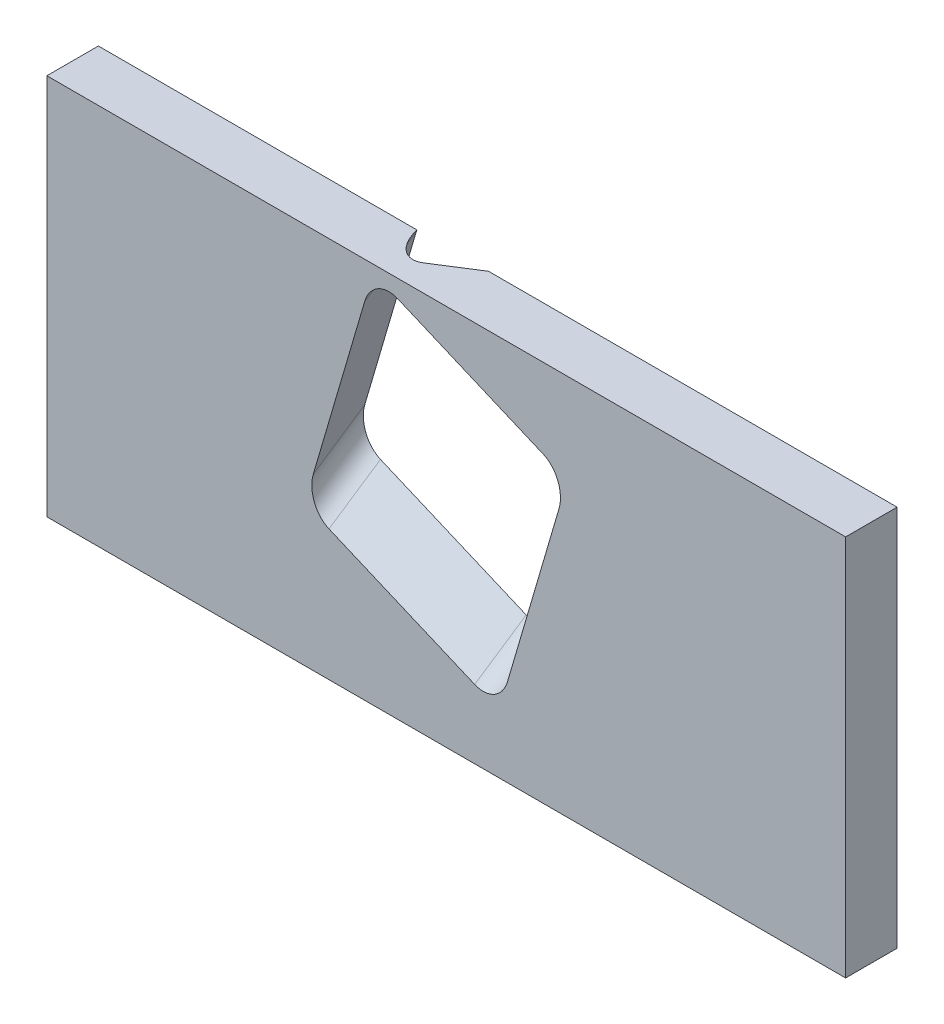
ISO-10303-21;
HEADER;
FILE_DESCRIPTION(('STEP AP214'),'2;1');
FILE_NAME('part.step','',(''),(''),'','','');
FILE_SCHEMA(('AUTOMOTIVE_DESIGN { 1 0 10303 214 1 1 1 1 }'));
ENDSEC;
DATA;
#1=APPLICATION_CONTEXT('core data for automotive mechanical design processes');
#2=APPLICATION_PROTOCOL_DEFINITION('international standard','automotive_design',2000,#1);
#3=PRODUCT_CONTEXT('',#1,'mechanical');
#4=PRODUCT('Part','Part','',(#3));
#5=PRODUCT_RELATED_PRODUCT_CATEGORY('part','',(#4));
#6=PRODUCT_DEFINITION_FORMATION('','',#4);
#7=PRODUCT_DEFINITION_CONTEXT('part definition',#1,'design');
#8=PRODUCT_DEFINITION('design','',#6,#7);
#9=PRODUCT_DEFINITION_SHAPE('','',#8);
#10=(LENGTH_UNIT() NAMED_UNIT(*) SI_UNIT(.MILLI.,.METRE.));
#11=(NAMED_UNIT(*) PLANE_ANGLE_UNIT() SI_UNIT($,.RADIAN.));
#12=(NAMED_UNIT(*) SI_UNIT($,.STERADIAN.) SOLID_ANGLE_UNIT());
#13=UNCERTAINTY_MEASURE_WITH_UNIT(LENGTH_MEASURE(1.E-05),#10,'distance_accuracy_value','');
#14=(GEOMETRIC_REPRESENTATION_CONTEXT(3) GLOBAL_UNCERTAINTY_ASSIGNED_CONTEXT((#13)) GLOBAL_UNIT_ASSIGNED_CONTEXT((#10,
#11,#12)) REPRESENTATION_CONTEXT('',''));
#15=CARTESIAN_POINT('',(0.,0.,0.));
#16=DIRECTION('',(0.,0.,1.));
#17=DIRECTION('',(1.,0.,0.));
#18=AXIS2_PLACEMENT_3D('',#15,#16,#17);
#19=CARTESIAN_POINT('',(-37.7894050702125,88.7717658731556,5.));
#20=DIRECTION('',(0.,-1.,0.));
#21=DIRECTION('',(0.,0.,-1.));
#22=AXIS2_PLACEMENT_3D('',#19,#20,#21);
#23=PLANE('',#22);
#24=CARTESIAN_POINT('',(-4.57644112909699,88.7717658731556,-1.80738180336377));
#25=DIRECTION('',(0.,-1.,0.));
#26=DIRECTION('',(0.,0.,1.));
#27=AXIS2_PLACEMENT_3D('',#24,#25,#26);
#28=ELLIPSE('',#27,4.49684408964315,2.5);
#29=CARTESIAN_POINT('',(-6.8656255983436,88.7717658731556,0.));
#30=VERTEX_POINT('',#29);
#31=CARTESIAN_POINT('',(-3.74443136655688,88.7717658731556,2.43312443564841));
#32=VERTEX_POINT('',#31);
#33=EDGE_CURVE('E188',#30,#32,#28,.F.);
#34=ORIENTED_EDGE('',*,*,#33,.F.);
#35=DIRECTION('',(-1.,0.,0.));
#36=VECTOR('',#35,1.);
#37=CARTESIAN_POINT('',(-37.7894050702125,88.7717658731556,0.));
#38=LINE('',#37,#36);
#39=CARTESIAN_POINT('',(-37.7894050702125,88.7717658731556,0.));
#40=VERTEX_POINT('',#39);
#41=EDGE_CURVE('E170',#30,#40,#38,.T.);
#42=ORIENTED_EDGE('',*,*,#41,.T.);
#43=DIRECTION('',(0.,0.,-1.));
#44=VECTOR('',#43,1.);
#45=CARTESIAN_POINT('',(-37.7894050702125,88.7717658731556,5.));
#46=LINE('',#45,#44);
#47=CARTESIAN_POINT('',(-37.7894050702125,88.7717658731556,5.));
#48=VERTEX_POINT('',#47);
#49=EDGE_CURVE('E160',#48,#40,#46,.T.);
#50=ORIENTED_EDGE('',*,*,#49,.F.);
#51=DIRECTION('',(-1.,0.,0.));
#52=VECTOR('',#51,1.);
#53=CARTESIAN_POINT('',(-37.7894050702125,88.7717658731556,5.));
#54=LINE('',#53,#52);
#55=CARTESIAN_POINT('',(39.7561399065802,88.7717658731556,5.));
#56=VERTEX_POINT('',#55);
#57=EDGE_CURVE('E147',#56,#48,#54,.T.);
#58=ORIENTED_EDGE('',*,*,#57,.F.);
#59=DIRECTION('',(0.,0.,-1.));
#60=VECTOR('',#59,1.);
#61=CARTESIAN_POINT('',(39.7561399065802,88.7717658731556,5.));
#62=LINE('',#61,#60);
#63=CARTESIAN_POINT('',(39.7561399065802,88.7717658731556,0.));
#64=VERTEX_POINT('',#63);
#65=EDGE_CURVE('E167',#56,#64,#62,.T.);
#66=ORIENTED_EDGE('',*,*,#65,.T.);
#67=CARTESIAN_POINT('',(0.0883845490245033,88.7717658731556,0.));
#68=VERTEX_POINT('',#67);
#69=EDGE_CURVE('E151',#64,#68,#38,.T.);
#70=ORIENTED_EDGE('',*,*,#69,.T.);
#71=DIRECTION('',(0.844253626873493,0.,-0.535943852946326));
#72=VECTOR('',#71,1.);
#73=CARTESIAN_POINT('',(-29.1719100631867,88.7717658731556,18.5748388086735));
#74=LINE('',#73,#72);
#75=EDGE_CURVE('E195',#32,#68,#74,.T.);
#76=ORIENTED_EDGE('',*,*,#75,.F.);
#77=EDGE_LOOP('',(#34,#42,#50,#58,#66,#70,#76));
#78=FACE_BOUND('',#77,.T.);
#79=ADVANCED_FACE('F33',(#78),#23,.F.);
#80=CARTESIAN_POINT('',(-37.7894050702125,51.6847661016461,5.));
#81=DIRECTION('',(0.,0.,1.));
#82=DIRECTION('',(1.,0.,0.));
#83=AXIS2_PLACEMENT_3D('',#80,#81,#82);
#84=PLANE('',#83);
#85=DIRECTION('',(0.,-1.,0.));
#86=VECTOR('',#85,1.);
#87=CARTESIAN_POINT('',(-37.7894050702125,88.7717658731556,5.));
#88=LINE('',#87,#86);
#89=CARTESIAN_POINT('',(-37.7894050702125,51.6847661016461,5.));
#90=VERTEX_POINT('',#89);
#91=EDGE_CURVE('E142',#48,#90,#88,.T.);
#92=ORIENTED_EDGE('',*,*,#91,.T.);
#93=DIRECTION('',(1.,0.,0.));
#94=VECTOR('',#93,1.);
#95=CARTESIAN_POINT('',(-37.7894050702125,51.6847661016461,5.));
#96=LINE('',#95,#94);
#97=CARTESIAN_POINT('',(39.7561399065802,51.6847661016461,5.));
#98=VERTEX_POINT('',#97);
#99=EDGE_CURVE('E131',#90,#98,#96,.T.);
#100=ORIENTED_EDGE('',*,*,#99,.T.);
#101=DIRECTION('',(0.,1.,0.));
#102=VECTOR('',#101,1.);
#103=CARTESIAN_POINT('',(39.7561399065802,88.7717658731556,5.));
#104=LINE('',#103,#102);
#105=EDGE_CURVE('E141',#98,#56,#104,.T.);
#106=ORIENTED_EDGE('',*,*,#105,.T.);
#107=ORIENTED_EDGE('',*,*,#57,.T.);
#108=EDGE_LOOP('',(#92,#100,#106,#107));
#109=FACE_BOUND('',#108,.T.);
#110=DIRECTION('',(-0.920468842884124,0.390815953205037,0.));
#111=VECTOR('',#110,1.);
#112=CARTESIAN_POINT('',(-29.0444218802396,72.2813781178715,5.));
#113=LINE('',#112,#111);
#114=CARTESIAN_POINT('',(3.74443136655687,58.359769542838,5.));
#115=VERTEX_POINT('',#114);
#116=CARTESIAN_POINT('',(-10.4005094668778,64.3654791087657,5.));
#117=VERTEX_POINT('',#116);
#118=EDGE_CURVE('E98',#115,#117,#113,.T.);
#119=ORIENTED_EDGE('',*,*,#118,.T.);
#120=CARTESIAN_POINT('',(-9.56849970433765,67.2016639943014,5.));
#121=DIRECTION('',(0.,0.,1.));
#122=DIRECTION('',(0.,-1.,0.));
#123=AXIS2_PLACEMENT_3D('',#120,#121,#122);
#124=ELLIPSE('',#123,3.0076317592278,2.5);
#125=CARTESIAN_POINT('',(-11.9259898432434,68.2026155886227,5.));
#126=VERTEX_POINT('',#125);
#127=EDGE_CURVE('E178',#117,#126,#124,.F.);
#128=ORIENTED_EDGE('',*,*,#127,.T.);
#129=DIRECTION('',(0.281492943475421,0.95956329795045,0.));
#130=VECTOR('',#129,1.);
#131=CARTESIAN_POINT('',(-18.4370035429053,46.0076372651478,5.));
#132=LINE('',#131,#130);
#133=CARTESIAN_POINT('',(-6.93393126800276,85.2197249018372,5.));
#134=VERTEX_POINT('',#133);
#135=EDGE_CURVE('E181',#126,#134,#132,.T.);
#136=ORIENTED_EDGE('',*,*,#135,.T.);
#137=CARTESIAN_POINT('',(-4.57644112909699,84.2187733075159,5.));
#138=DIRECTION('',(0.,0.,1.));
#139=DIRECTION('',(0.,-1.,0.));
#140=AXIS2_PLACEMENT_3D('',#137,#138,#139);
#141=ELLIPSE('',#140,3.0076317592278,2.5);
#142=CARTESIAN_POINT('',(-3.74443136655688,87.0549581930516,5.));
#143=VERTEX_POINT('',#142);
#144=EDGE_CURVE('E184',#134,#143,#141,.F.);
#145=ORIENTED_EDGE('',*,*,#144,.T.);
#146=DIRECTION('',(0.920468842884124,-0.390815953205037,0.));
#147=VECTOR('',#146,1.);
#148=CARTESIAN_POINT('',(-19.865616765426,93.8997487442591,5.));
#149=LINE('',#148,#147);
#150=CARTESIAN_POINT('',(10.4005094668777,81.0492486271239,5.));
#151=VERTEX_POINT('',#150);
#152=EDGE_CURVE('E187',#143,#151,#149,.T.);
#153=ORIENTED_EDGE('',*,*,#152,.T.);
#154=CARTESIAN_POINT('',(9.56849970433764,78.2130637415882,5.));
#155=DIRECTION('',(0.,0.,1.));
#156=DIRECTION('',(0.,-1.,0.));
#157=AXIS2_PLACEMENT_3D('',#154,#155,#156);
#158=ELLIPSE('',#157,3.0076317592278,2.5);
#159=CARTESIAN_POINT('',(11.9259898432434,77.2121121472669,5.));
#160=VERTEX_POINT('',#159);
#161=EDGE_CURVE('E194',#151,#160,#158,.F.);
#162=ORIENTED_EDGE('',*,*,#161,.T.);
#163=DIRECTION('',(-0.281492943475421,-0.95956329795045,0.));
#164=VECTOR('',#163,1.);
#165=CARTESIAN_POINT('',(1.09142857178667,40.2788689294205,5.));
#166=LINE('',#165,#164);
#167=CARTESIAN_POINT('',(6.93393126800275,60.1950028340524,5.));
#168=VERTEX_POINT('',#167);
#169=EDGE_CURVE('E201',#160,#168,#166,.T.);
#170=ORIENTED_EDGE('',*,*,#169,.T.);
#171=CARTESIAN_POINT('',(4.57644112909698,61.1959544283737,5.));
#172=DIRECTION('',(0.,0.,1.));
#173=DIRECTION('',(0.,-1.,0.));
#174=AXIS2_PLACEMENT_3D('',#171,#172,#173);
#175=ELLIPSE('',#174,3.0076317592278,2.5);
#176=EDGE_CURVE('E175',#168,#115,#175,.F.);
#177=ORIENTED_EDGE('',*,*,#176,.T.);
#178=EDGE_LOOP('',(#119,#128,#136,#145,#153,#162,#170,#177));
#179=FACE_BOUND('',#178,.T.);
#180=ADVANCED_FACE('F35',(#109,#179),#84,.T.);
#181=CARTESIAN_POINT('',(-37.7894050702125,51.6847661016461,0.));
#182=DIRECTION('',(0.,0.,1.));
#183=DIRECTION('',(1.,0.,0.));
#184=AXIS2_PLACEMENT_3D('',#181,#182,#183);
#185=PLANE('',#184);
#186=CARTESIAN_POINT('',(-4.57644112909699,87.5629316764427,0.));
#187=DIRECTION('',(0.,0.,1.));
#188=DIRECTION('',(0.,-1.,0.));
#189=AXIS2_PLACEMENT_3D('',#186,#187,#188);
#190=ELLIPSE('',#189,3.0076317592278,2.5);
#191=CARTESIAN_POINT('',(-6.93393126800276,88.563883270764,0.));
#192=VERTEX_POINT('',#191);
#193=EDGE_CURVE('E191',#192,#30,#190,.F.);
#194=ORIENTED_EDGE('',*,*,#193,.F.);
#195=DIRECTION('',(0.281492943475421,0.95956329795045,0.));
#196=VECTOR('',#195,1.);
#197=CARTESIAN_POINT('',(-19.3402951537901,46.2726226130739,0.));
#198=LINE('',#197,#196);
#199=CARTESIAN_POINT('',(-11.9259898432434,71.5467739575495,0.));
#200=VERTEX_POINT('',#199);
#201=EDGE_CURVE('E210',#200,#192,#198,.T.);
#202=ORIENTED_EDGE('',*,*,#201,.F.);
#203=CARTESIAN_POINT('',(-9.56849970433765,70.5458223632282,0.));
#204=DIRECTION('',(0.,0.,1.));
#205=DIRECTION('',(0.,-1.,0.));
#206=AXIS2_PLACEMENT_3D('',#203,#204,#205);
#207=ELLIPSE('',#206,3.0076317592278,2.5);
#208=CARTESIAN_POINT('',(-10.4005094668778,67.7096374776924,0.));
#209=VERTEX_POINT('',#208);
#210=EDGE_CURVE('E43',#209,#200,#207,.F.);
#211=ORIENTED_EDGE('',*,*,#210,.F.);
#212=DIRECTION('',(-0.920468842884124,0.390815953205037,0.));
#213=VECTOR('',#212,1.);
#214=CARTESIAN_POINT('',(-27.8414147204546,75.1147594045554,0.));
#215=LINE('',#214,#213);
#216=CARTESIAN_POINT('',(3.74443136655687,61.7039279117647,0.));
#217=VERTEX_POINT('',#216);
#218=EDGE_CURVE('E164',#217,#209,#215,.T.);
#219=ORIENTED_EDGE('',*,*,#218,.F.);
#220=CARTESIAN_POINT('',(4.57644112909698,64.5401127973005,0.));
#221=DIRECTION('',(0.,0.,1.));
#222=DIRECTION('',(0.,-1.,0.));
#223=AXIS2_PLACEMENT_3D('',#220,#221,#222);
#224=ELLIPSE('',#223,3.0076317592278,2.5);
#225=CARTESIAN_POINT('',(6.93393126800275,63.5391612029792,0.));
#226=VERTEX_POINT('',#225);
#227=EDGE_CURVE('E223',#226,#217,#224,.F.);
#228=ORIENTED_EDGE('',*,*,#227,.F.);
#229=DIRECTION('',(-0.281492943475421,-0.95956329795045,0.));
#230=VECTOR('',#229,1.);
#231=CARTESIAN_POINT('',(0.188136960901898,40.5438542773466,0.));
#232=LINE('',#231,#230);
#233=CARTESIAN_POINT('',(11.9259898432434,80.5562705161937,0.));
#234=VERTEX_POINT('',#233);
#235=EDGE_CURVE('E221',#234,#226,#232,.T.);
#236=ORIENTED_EDGE('',*,*,#235,.F.);
#237=CARTESIAN_POINT('',(9.56849970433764,81.557222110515,0.));
#238=DIRECTION('',(0.,0.,1.));
#239=DIRECTION('',(0.,-1.,0.));
#240=AXIS2_PLACEMENT_3D('',#237,#238,#239);
#241=ELLIPSE('',#240,3.0076317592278,2.5);
#242=CARTESIAN_POINT('',(10.4005094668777,84.3934069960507,0.));
#243=VERTEX_POINT('',#242);
#244=EDGE_CURVE('E218',#243,#234,#241,.F.);
#245=ORIENTED_EDGE('',*,*,#244,.F.);
#246=DIRECTION('',(0.920468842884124,-0.390815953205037,0.));
#247=VECTOR('',#246,1.);
#248=CARTESIAN_POINT('',(-18.6626096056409,96.733130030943,0.));
#249=LINE('',#248,#247);
#250=EDGE_CURVE('E197',#68,#243,#249,.T.);
#251=ORIENTED_EDGE('',*,*,#250,.F.);
#252=ORIENTED_EDGE('',*,*,#69,.F.);
#253=DIRECTION('',(0.,1.,0.));
#254=VECTOR('',#253,1.);
#255=CARTESIAN_POINT('',(39.7561399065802,88.7717658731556,0.));
#256=LINE('',#255,#254);
#257=CARTESIAN_POINT('',(39.7561399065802,51.6847661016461,0.));
#258=VERTEX_POINT('',#257);
#259=EDGE_CURVE('E156',#258,#64,#256,.T.);
#260=ORIENTED_EDGE('',*,*,#259,.F.);
#261=DIRECTION('',(1.,0.,0.));
#262=VECTOR('',#261,1.);
#263=CARTESIAN_POINT('',(-37.7894050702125,51.6847661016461,0.));
#264=LINE('',#263,#262);
#265=CARTESIAN_POINT('',(-37.7894050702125,51.6847661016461,0.));
#266=VERTEX_POINT('',#265);
#267=EDGE_CURVE('E157',#266,#258,#264,.T.);
#268=ORIENTED_EDGE('',*,*,#267,.F.);
#269=DIRECTION('',(0.,-1.,0.));
#270=VECTOR('',#269,1.);
#271=CARTESIAN_POINT('',(-37.7894050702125,88.7717658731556,0.));
#272=LINE('',#271,#270);
#273=EDGE_CURVE('E155',#40,#266,#272,.T.);
#274=ORIENTED_EDGE('',*,*,#273,.F.);
#275=ORIENTED_EDGE('',*,*,#41,.F.);
#276=EDGE_LOOP('',(#194,#202,#211,#219,#228,#236,#245,#251,#252,#260,#268,#274,#275));
#277=FACE_BOUND('',#276,.T.);
#278=ADVANCED_FACE('F246',(#277),#185,.F.);
#279=CARTESIAN_POINT('',(-37.7894050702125,88.7717658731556,5.));
#280=DIRECTION('',(1.,0.,0.));
#281=DIRECTION('',(0.,0.,-1.));
#282=AXIS2_PLACEMENT_3D('',#279,#280,#281);
#283=PLANE('',#282);
#284=ORIENTED_EDGE('',*,*,#273,.T.);
#285=DIRECTION('',(0.,0.,-1.));
#286=VECTOR('',#285,1.);
#287=CARTESIAN_POINT('',(-37.7894050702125,51.6847661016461,5.));
#288=LINE('',#287,#286);
#289=EDGE_CURVE('E135',#90,#266,#288,.T.);
#290=ORIENTED_EDGE('',*,*,#289,.F.);
#291=ORIENTED_EDGE('',*,*,#91,.F.);
#292=ORIENTED_EDGE('',*,*,#49,.T.);
#293=EDGE_LOOP('',(#284,#290,#291,#292));
#294=FACE_BOUND('',#293,.T.);
#295=ADVANCED_FACE('F153',(#294),#283,.F.);
#296=CARTESIAN_POINT('',(-37.7894050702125,51.6847661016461,5.));
#297=DIRECTION('',(0.,1.,0.));
#298=DIRECTION('',(0.,0.,1.));
#299=AXIS2_PLACEMENT_3D('',#296,#297,#298);
#300=PLANE('',#299);
#301=ORIENTED_EDGE('',*,*,#267,.T.);
#302=DIRECTION('',(0.,0.,-1.));
#303=VECTOR('',#302,1.);
#304=CARTESIAN_POINT('',(39.7561399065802,51.6847661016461,5.));
#305=LINE('',#304,#303);
#306=EDGE_CURVE('E138',#98,#258,#305,.T.);
#307=ORIENTED_EDGE('',*,*,#306,.F.);
#308=ORIENTED_EDGE('',*,*,#99,.F.);
#309=ORIENTED_EDGE('',*,*,#289,.T.);
#310=EDGE_LOOP('',(#301,#307,#308,#309));
#311=FACE_BOUND('',#310,.T.);
#312=ADVANCED_FACE('F133',(#311),#300,.F.);
#313=CARTESIAN_POINT('',(39.7561399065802,88.7717658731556,5.));
#314=DIRECTION('',(-1.,0.,0.));
#315=DIRECTION('',(0.,0.,1.));
#316=AXIS2_PLACEMENT_3D('',#313,#314,#315);
#317=PLANE('',#316);
#318=ORIENTED_EDGE('',*,*,#259,.T.);
#319=ORIENTED_EDGE('',*,*,#65,.F.);
#320=ORIENTED_EDGE('',*,*,#105,.F.);
#321=ORIENTED_EDGE('',*,*,#306,.T.);
#322=EDGE_LOOP('',(#318,#319,#320,#321));
#323=FACE_BOUND('',#322,.T.);
#324=ADVANCED_FACE('F250',(#323),#317,.F.);
#325=CARTESIAN_POINT('',(-10.4005094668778,75.2498544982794,-11.2737140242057));
#326=DIRECTION('',(0.332803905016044,0.783836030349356,0.524254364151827));
#327=DIRECTION('',(0.,-0.555945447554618,0.831218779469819));
#328=AXIS2_PLACEMENT_3D('',#325,#326,#327);
#329=PLANE('',#328);
#330=DIRECTION('',(0.,-0.555945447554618,0.831218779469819));
#331=VECTOR('',#330,1.);
#332=CARTESIAN_POINT('',(3.74443136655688,71.100361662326,-14.0490262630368));
#333=LINE('',#332,#331);
#334=EDGE_CURVE('E222',#217,#115,#333,.T.);
#335=ORIENTED_EDGE('',*,*,#334,.F.);
#336=ORIENTED_EDGE('',*,*,#218,.T.);
#337=DIRECTION('',(0.,-0.555945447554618,0.831218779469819));
#338=VECTOR('',#337,1.);
#339=CARTESIAN_POINT('',(-10.4005094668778,75.2498544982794,-11.2737140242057));
#340=LINE('',#339,#338);
#341=EDGE_CURVE('E37',#209,#117,#340,.T.);
#342=ORIENTED_EDGE('',*,*,#341,.T.);
#343=ORIENTED_EDGE('',*,*,#118,.F.);
#344=EDGE_LOOP('',(#335,#336,#342,#343));
#345=FACE_BOUND('',#344,.T.);
#346=ADVANCED_FACE('F264',(#345),#329,.T.);
#347=CARTESIAN_POINT('',(4.57644112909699,73.0599517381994,-12.7383903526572));
#348=DIRECTION('',(0.,-0.555945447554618,0.831218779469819));
#349=DIRECTION('',(-0.332803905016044,-0.783836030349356,-0.524254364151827));
#350=AXIS2_PLACEMENT_3D('',#347,#348,#349);
#351=CYLINDRICAL_SURFACE('',#350,2.5);
#352=DIRECTION('',(0.,-0.555945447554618,0.831218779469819));
#353=VECTOR('',#352,1.);
#354=CARTESIAN_POINT('',(6.93393126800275,72.3683695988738,-13.2009423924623));
#355=LINE('',#354,#353);
#356=EDGE_CURVE('E219',#226,#168,#355,.T.);
#357=ORIENTED_EDGE('',*,*,#356,.F.);
#358=ORIENTED_EDGE('',*,*,#227,.T.);
#359=ORIENTED_EDGE('',*,*,#334,.T.);
#360=ORIENTED_EDGE('',*,*,#176,.F.);
#361=EDGE_LOOP('',(#357,#358,#359,#360));
#362=FACE_BOUND('',#361,.T.);
#363=ADVANCED_FACE('F266',(#362),#351,.F.);
#364=CARTESIAN_POINT('',(11.9259898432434,84.1259100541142,-5.33712693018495));
#365=DIRECTION('',(-0.942996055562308,0.276632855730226,0.185020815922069));
#366=DIRECTION('',(0.332803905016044,0.783836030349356,0.524254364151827));
#367=AXIS2_PLACEMENT_3D('',#364,#365,#366);
#368=PLANE('',#367);
#369=DIRECTION('',(0.,-0.555945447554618,0.831218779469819));
#370=VECTOR('',#369,1.);
#371=CARTESIAN_POINT('',(11.9259898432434,84.1259100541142,-5.33712693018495));
#372=LINE('',#371,#370);
#373=EDGE_CURVE('E198',#234,#160,#372,.T.);
#374=ORIENTED_EDGE('',*,*,#373,.F.);
#375=ORIENTED_EDGE('',*,*,#235,.T.);
#376=ORIENTED_EDGE('',*,*,#356,.T.);
#377=ORIENTED_EDGE('',*,*,#169,.F.);
#378=EDGE_LOOP('',(#374,#375,#376,#377));
#379=FACE_BOUND('',#378,.T.);
#380=ADVANCED_FACE('F272',(#379),#368,.T.);
#381=CARTESIAN_POINT('',(9.56849970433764,84.8174921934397,-4.87457489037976));
#382=DIRECTION('',(0.,-0.555945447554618,0.831218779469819));
#383=DIRECTION('',(-0.332803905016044,-0.783836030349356,-0.524254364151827));
#384=AXIS2_PLACEMENT_3D('',#381,#382,#383);
#385=CYLINDRICAL_SURFACE('',#384,2.5);
#386=DIRECTION('',(0.,-0.555945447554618,0.831218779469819));
#387=VECTOR('',#386,1.);
#388=CARTESIAN_POINT('',(10.4005094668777,86.7770822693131,-3.56393898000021));
#389=LINE('',#388,#387);
#390=EDGE_CURVE('E213',#243,#151,#389,.T.);
#391=ORIENTED_EDGE('',*,*,#390,.F.);
#392=ORIENTED_EDGE('',*,*,#244,.T.);
#393=ORIENTED_EDGE('',*,*,#373,.T.);
#394=ORIENTED_EDGE('',*,*,#161,.F.);
#395=EDGE_LOOP('',(#391,#392,#393,#394));
#396=FACE_BOUND('',#395,.T.);
#397=ADVANCED_FACE('F259',(#396),#385,.F.);
#398=CARTESIAN_POINT('',(10.4005094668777,86.7770822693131,-3.56393898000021));
#399=DIRECTION('',(-0.332803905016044,-0.783836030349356,-0.524254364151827));
#400=DIRECTION('',(0.,0.555945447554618,-0.831218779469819));
#401=AXIS2_PLACEMENT_3D('',#398,#399,#400);
#402=PLANE('',#401);
#403=DIRECTION('',(0.,-0.555945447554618,0.831218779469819));
#404=VECTOR('',#403,1.);
#405=CARTESIAN_POINT('',(-3.74443136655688,90.9265751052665,-0.788626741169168));
#406=LINE('',#405,#404);
#407=EDGE_CURVE('E190',#32,#143,#406,.T.);
#408=ORIENTED_EDGE('',*,*,#407,.F.);
#409=ORIENTED_EDGE('',*,*,#75,.T.);
#410=ORIENTED_EDGE('',*,*,#250,.T.);
#411=ORIENTED_EDGE('',*,*,#390,.T.);
#412=ORIENTED_EDGE('',*,*,#152,.F.);
#413=EDGE_LOOP('',(#408,#409,#410,#411,#412));
#414=FACE_BOUND('',#413,.T.);
#415=ADVANCED_FACE('F257',(#414),#402,.T.);
#416=CARTESIAN_POINT('',(-4.57644112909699,88.9669850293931,-2.09926265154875));
#417=DIRECTION('',(0.,-0.555945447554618,0.831218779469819));
#418=DIRECTION('',(-0.332803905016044,-0.783836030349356,-0.524254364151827));
#419=AXIS2_PLACEMENT_3D('',#416,#417,#418);
#420=CYLINDRICAL_SURFACE('',#419,2.5);
#421=DIRECTION('',(0.,-0.555945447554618,0.831218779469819));
#422=VECTOR('',#421,1.);
#423=CARTESIAN_POINT('',(-6.93393126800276,89.6585671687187,-1.63671061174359));
#424=LINE('',#423,#422);
#425=EDGE_CURVE('E207',#192,#134,#424,.T.);
#426=ORIENTED_EDGE('',*,*,#425,.F.);
#427=ORIENTED_EDGE('',*,*,#193,.T.);
#428=ORIENTED_EDGE('',*,*,#33,.T.);
#429=ORIENTED_EDGE('',*,*,#407,.T.);
#430=ORIENTED_EDGE('',*,*,#144,.F.);
#431=EDGE_LOOP('',(#426,#427,#428,#429,#430));
#432=FACE_BOUND('',#431,.T.);
#433=ADVANCED_FACE('F239',(#432),#420,.F.);
#434=CARTESIAN_POINT('',(-11.9259898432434,77.9010267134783,-9.50052607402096));
#435=DIRECTION('',(0.942996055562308,-0.276632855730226,-0.185020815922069));
#436=DIRECTION('',(-0.332803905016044,-0.783836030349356,-0.524254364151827));
#437=AXIS2_PLACEMENT_3D('',#434,#435,#436);
#438=PLANE('',#437);
#439=DIRECTION('',(0.,-0.555945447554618,0.831218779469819));
#440=VECTOR('',#439,1.);
#441=CARTESIAN_POINT('',(-11.9259898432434,77.9010267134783,-9.50052607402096));
#442=LINE('',#441,#440);
#443=EDGE_CURVE('E11',#200,#126,#442,.T.);
#444=ORIENTED_EDGE('',*,*,#443,.F.);
#445=ORIENTED_EDGE('',*,*,#201,.T.);
#446=ORIENTED_EDGE('',*,*,#425,.T.);
#447=ORIENTED_EDGE('',*,*,#135,.F.);
#448=EDGE_LOOP('',(#444,#445,#446,#447));
#449=FACE_BOUND('',#448,.T.);
#450=ADVANCED_FACE('F262',(#449),#438,.T.);
#451=CARTESIAN_POINT('',(-9.56849970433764,77.2094445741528,-9.96307811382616));
#452=DIRECTION('',(0.,-0.555945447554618,0.831218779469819));
#453=DIRECTION('',(-0.332803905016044,-0.783836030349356,-0.524254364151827));
#454=AXIS2_PLACEMENT_3D('',#451,#452,#453);
#455=CYLINDRICAL_SURFACE('',#454,2.5);
#456=ORIENTED_EDGE('',*,*,#341,.F.);
#457=ORIENTED_EDGE('',*,*,#210,.T.);
#458=ORIENTED_EDGE('',*,*,#443,.T.);
#459=ORIENTED_EDGE('',*,*,#127,.F.);
#460=EDGE_LOOP('',(#456,#457,#458,#459));
#461=FACE_BOUND('',#460,.T.);
#462=ADVANCED_FACE('F263',(#461),#455,.F.);
#463=CLOSED_SHELL('',(#79,#180,#278,#295,#312,#324,#346,#363,#380,#397,#415,#433,#450,#462));
#464=MANIFOLD_SOLID_BREP('B2',#463);
#465=ADVANCED_BREP_SHAPE_REPRESENTATION('',(#18,#464),#14);
#466=SHAPE_DEFINITION_REPRESENTATION(#9,#465);
ENDSEC;
END-ISO-10303-21;
